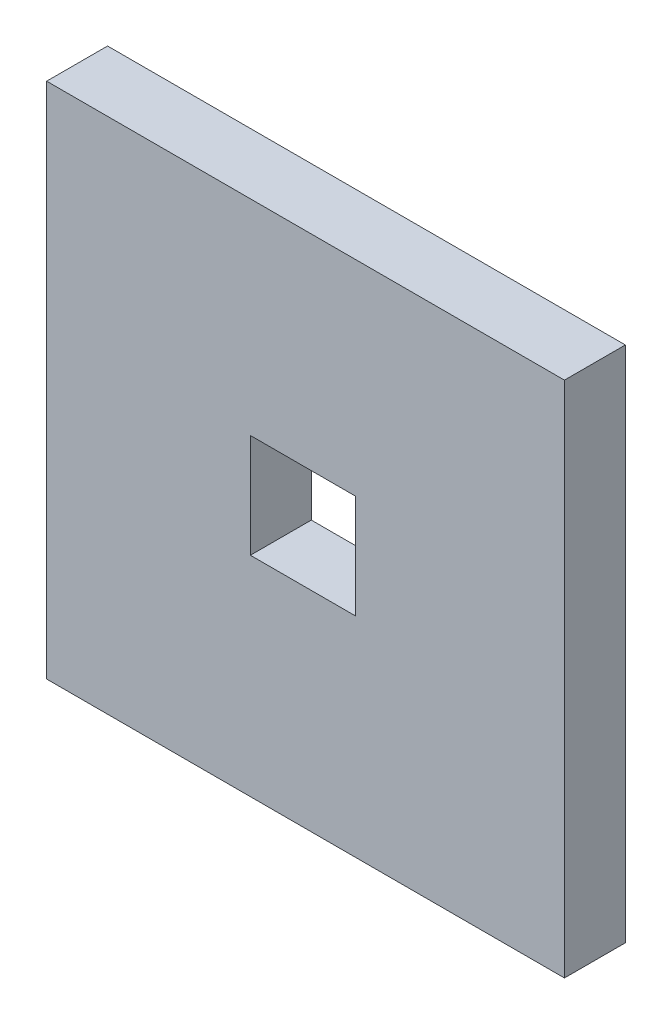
from build123d import *

# Parameters (mm, degrees)
SCHIZZO1_W                        = 68
SCHIZZO1_H                        = 68
SCHIZZO1_W_2                      = 60
SCHIZZO1_H_2                      = 60
SCHIZZO1_W_3                      = 21.49
SCHIZZO1_H_3                      = 21.490369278
ESTRUSIONE_ESTRUSIONE1_DEPTH      = 3
ESTRUSIONE_ESTRUSIONE2_DEPTH      = 3
ESTRUSIONE_ESTRUSIONE2_DEPTH_BACK = 5
SCHIZZO1_3_W                      = 68
SCHIZZO1_3_H                      = 68
SCHIZZO1_3_W_2                    = 60
SCHIZZO1_3_H_2                    = 60
SCHIZZO1_3_W_3                    = 21.49
SCHIZZO1_3_H_3                    = 21.490369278
TAGLIO_ESTRUSIONE1_REACH          = 76.954
SCHIZZO2_W                        = 13.778511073
SCHIZZO2_H                        = 13.623696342
ESTRUSIONE_ESTRUSIONE3_DEPTH      = 0.29
SCHIZZO4_W                        = 2
SCHIZZO4_H                        = 5
SCHIZZO4_W_2                      = 5
SCHIZZO4_H_2                      = 2
TAGLIO_ESTRUSIONE2_DEPTH          = 4.71
SCHIZZO4_3_W                      = 5
SCHIZZO4_3_H                      = 2
SCHIZZO4_3_W_2                    = 2
SCHIZZO4_3_H_2                    = 5
TAGLIO_ESTRUSIONE3_DEPTH          = 5
RACCORDO1_R                       = 2
ESTRUSIONE_ESTRUSIONE4_DEPTH      = 5


with BuildPart() as part:
    # Schizzo1 → Estrusione-Estrusione1 (new body)
    # profile 1 of 3: a face of its own
    with BuildSketch(Plane.XY):
        with Locations((-19.629138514, -17.749150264)):
            Rectangle(SCHIZZO1_W, SCHIZZO1_H)
        with Locations((-19.629138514, -17.749150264)):
            Rectangle(SCHIZZO1_W_2, SCHIZZO1_H_2, mode=Mode.SUBTRACT)
    # profile 2 of 3: a face of its own
    with BuildSketch(Plane.XY):
        with Locations((-19.629138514, -17.749150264)):
            Rectangle(SCHIZZO1_W_2, SCHIZZO1_H_2)
        with Locations((-19.944226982, -17.547606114)):
            Rectangle(SCHIZZO1_W_3, SCHIZZO1_H_3, mode=Mode.SUBTRACT)
    # profile 3 of 3: a face of its own
    with BuildSketch(Plane.XY):
        Polygon((-30.689226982, -28.292790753), (-30.689226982, -6.802421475), (-30.689226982, 12.250849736), (-49.629138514, 12.250849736), (-49.629138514, -47.749150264), (-30.689226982, -47.749150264), align=None)
    extrude(amount=ESTRUSIONE_ESTRUSIONE1_DEPTH)

    # Schizzo1_3 → Estrusione-Estrusione2 (add, two sides: drawn at the far end of the back side and taken through both)
    # profile 1 of 2: a face of its own
    with BuildSketch(Plane.XY.offset(-ESTRUSIONE_ESTRUSIONE2_DEPTH_BACK)):
        with Locations((-19.629138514, -17.749150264)):
            Rectangle(SCHIZZO1_3_W, SCHIZZO1_3_H)
        with Locations((-19.629138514, -17.749150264)):
            Rectangle(SCHIZZO1_3_W_2, SCHIZZO1_3_H_2, mode=Mode.SUBTRACT)
    # profile 2 of 2: a face of its own
    with BuildSketch(Plane.XY.offset(-ESTRUSIONE_ESTRUSIONE2_DEPTH_BACK)):
        with Locations((-19.944226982, -17.547606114)):
            Rectangle(SCHIZZO1_3_W_3, SCHIZZO1_3_H_3)
    extrude(amount=ESTRUSIONE_ESTRUSIONE2_DEPTH + ESTRUSIONE_ESTRUSIONE2_DEPTH_BACK)

    # Schizzo2 → Taglio-Estrusione1 (cut, up to next)
    with BuildSketch(Plane(origin=(0, 0, -5), x_dir=(-1, 0, 0), z_dir=(0, 0, -1)), mode=Mode.PRIVATE) as taglio_estrusione1_sk1:
        with Locations((19.982931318, -17.478322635)):
            Rectangle(SCHIZZO2_W, SCHIZZO2_H)
    taglio_estrusione1_tool1 = extrude(taglio_estrusione1_sk1.sketch, amount=-TAGLIO_ESTRUSIONE1_REACH, mode=Mode.PRIVATE) & part.part
    add(taglio_estrusione1_tool1.solids().sort_by_distance((-19.982931, -17.478323, -5))[0], mode=Mode.SUBTRACT)

    # Schizzo1_4 → Estrusione-Estrusione3 (add)
    with BuildSketch(Plane.XY):
        Polygon((-30.689226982, -6.802421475), (-9.199226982, -6.802421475), (-9.199226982, -28.292790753), (-30.689226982, -28.292790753), (-30.689226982, -47.749150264), (10.370861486, -47.749150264), (10.370861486, 12.250849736), (-30.689226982, 12.250849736), align=None)
    extrude(amount=-ESTRUSIONE_ESTRUSIONE3_DEPTH)

    # Schizzo4 → Taglio-Estrusione2 (cut)
    with BuildSketch(Plane(origin=(0, 0, -5), x_dir=(-1, 0, 0), z_dir=(0, 0, -1))):
        with Locations((-11.370861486, 9.750849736)):
            Rectangle(SCHIZZO4_W, SCHIZZO4_H)
        with Locations((-7.870861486, -48.749150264)):
            Rectangle(SCHIZZO4_W_2, SCHIZZO4_H_2)
    extrude(amount=-TAGLIO_ESTRUSIONE2_DEPTH, mode=Mode.SUBTRACT)

    # Schizzo4_3 → Taglio-Estrusione3 (cut)
    with BuildSketch(Plane(origin=(0, 0, -5), x_dir=(-1, 0, 0), z_dir=(0, 0, -1))):
        with Locations((47.129138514, 13.250849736)):
            Rectangle(SCHIZZO4_3_W, SCHIZZO4_3_H)
        with Locations((50.629138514, -45.249150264)):
            Rectangle(SCHIZZO4_3_W_2, SCHIZZO4_3_H_2)
    extrude(amount=-TAGLIO_ESTRUSIONE3_DEPTH, mode=Mode.SUBTRACT)

    # Raccordo1
    raccordo1_edges = [part.edges().sort_by_distance(p)[0] for p in [
        (12.370861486, 9.750849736, -0.29),
        (-47.129138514, 14.250849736, 0),
        (-51.629138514, -45.249150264, 0),
        (7.870861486, -49.749150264, -0.29),
    ]]
    fillet(raccordo1_edges, radius=RACCORDO1_R)

    # Schizzo5 → Estrusione-Estrusione4 (add)
    with BuildSketch(Plane(origin=(0, 0, 0), x_dir=(-1, 0, 0), z_dir=(0, 0, -1))):
        with BuildLine():
            Line((13.197997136, -6.802421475), (11.200456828, -6.802421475))
            ThreePointArc((11.200456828, -6.802421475), (12.199226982, -5.803651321), (13.197997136, -6.802421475))
        make_face()
        with BuildLine():
            Line((30.689226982, -22.696210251), (30.689226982, -24.689371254))
            ThreePointArc((30.689226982, -24.689371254), (31.685807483, -23.692790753), (30.689226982, -22.696210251))
        make_face()
    extrude(amount=ESTRUSIONE_ESTRUSIONE4_DEPTH)


solid = part.part
